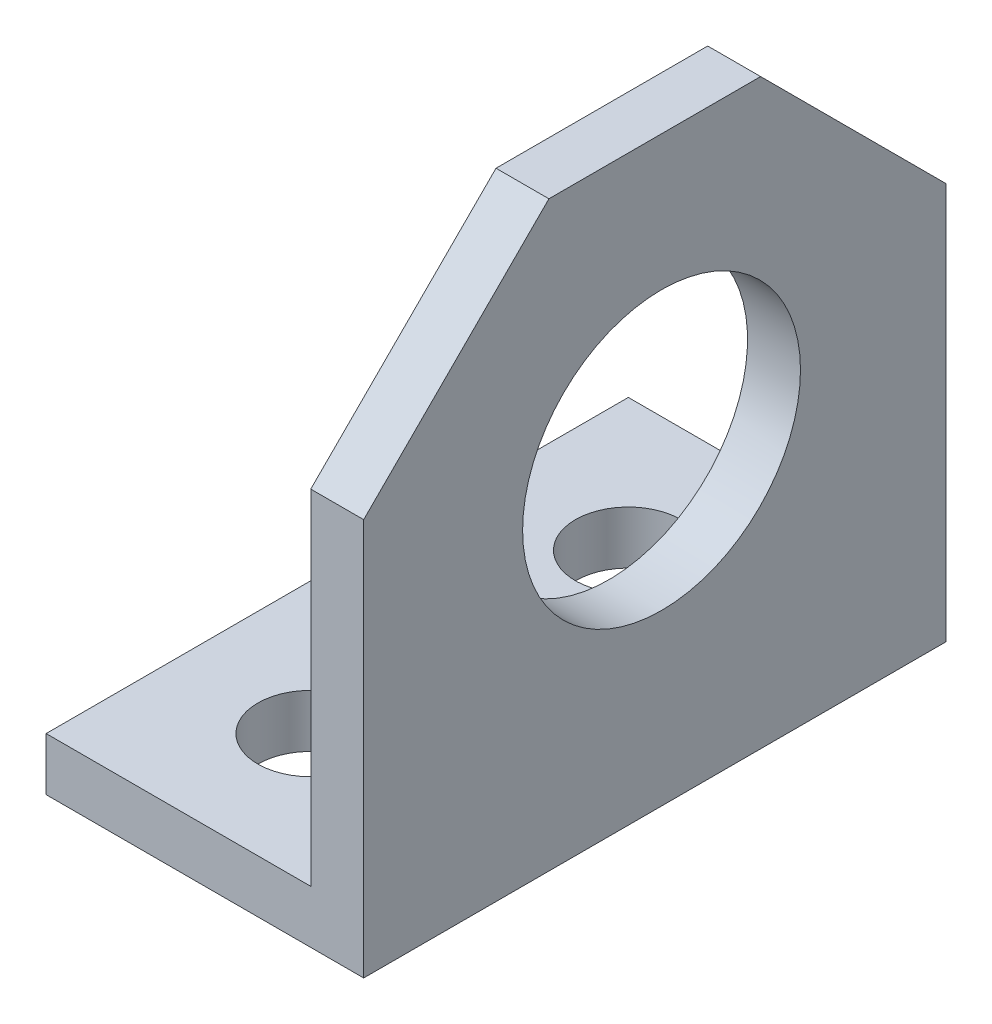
from build123d import *

# Parameters (mm, degrees)
EXTRU_MINCE1_DEPTH      = 11
CHANFREIN1_SIZE         = 7
ESQUISSE4_R             = 2
ENL_V_MAT_EXTRU_2_DEPTH = 10.5
ESQUISSE5_R             = 5.25
ENL_V_MAT_EXTRU_3_DEPTH = 10


with BuildPart() as part:
    # Esquisse1 → Extru.-Mince1 (new, symmetric)
    with BuildSketch(Plane.XY):
        Polygon((-12, 0), (0, 0), (0, 22), (-2, 22), (-2, 2), (-12, 2), align=None)
    extrude(amount=EXTRU_MINCE1_DEPTH, both=True)

    # Chanfrein1
    chanfrein1_edges = [part.edges().sort_by_distance(p)[0] for p in [
        (-1, 22, 11),
        (-1, 22, -11),
    ]]
    chamfer(chanfrein1_edges, length=CHANFREIN1_SIZE)

    # Esquisse4 → Enl_v. mat.-Extru.2 (cut)
    with BuildSketch(Plane(origin=(0, 2, 0), x_dir=(1, 0, 0), z_dir=(0, 1, 0))):
        with Locations(Location((-7, 6, 0), (0, 0, 180))):
            Circle(ESQUISSE4_R)
        with Locations(Location((-7, -6, 0), (0, 0, 180))):
            Circle(ESQUISSE4_R)
    extrude(amount=-ENL_V_MAT_EXTRU_2_DEPTH, mode=Mode.SUBTRACT)

    # Esquisse5 → Enl_v. mat.-Extru.3 (cut)
    with BuildSketch(Plane.ZY.offset(2)):
        with Locations((-0.255547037, 11.64843331)):
            Circle(ESQUISSE5_R)
    extrude(amount=-ENL_V_MAT_EXTRU_3_DEPTH, mode=Mode.SUBTRACT)


solid = part.part
